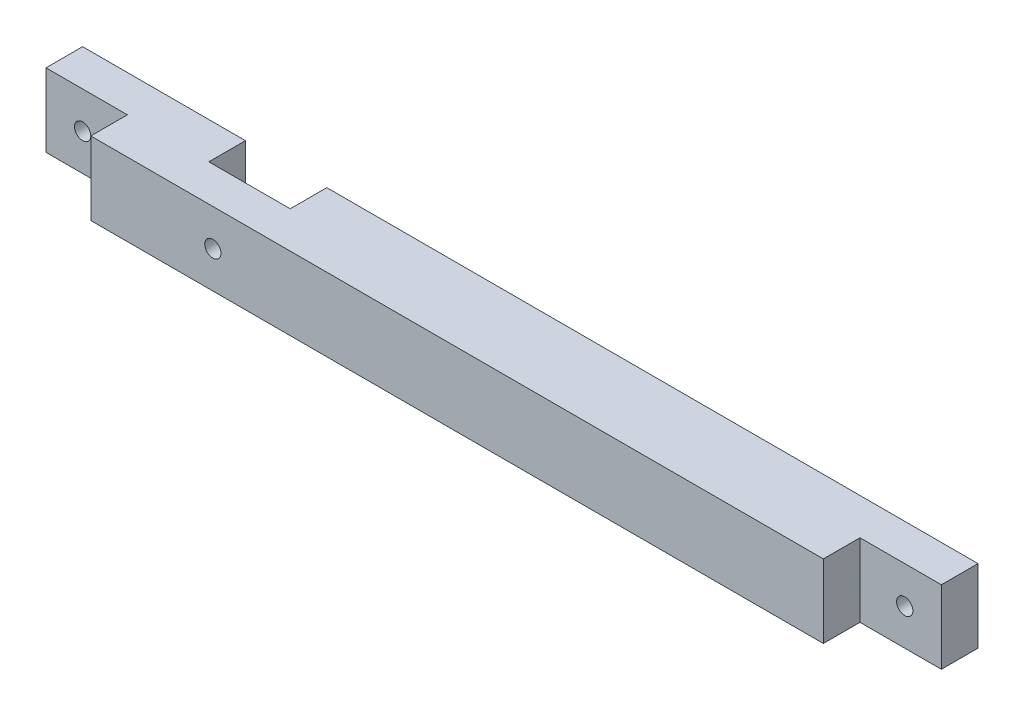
ISO-10303-21;
HEADER;
FILE_DESCRIPTION(('STEP AP214'),'2;1');
FILE_NAME('part.step','',(''),(''),'','','');
FILE_SCHEMA(('AUTOMOTIVE_DESIGN { 1 0 10303 214 1 1 1 1 }'));
ENDSEC;
DATA;
#1=APPLICATION_CONTEXT('core data for automotive mechanical design processes');
#2=APPLICATION_PROTOCOL_DEFINITION('international standard','automotive_design',2000,#1);
#3=PRODUCT_CONTEXT('',#1,'mechanical');
#4=PRODUCT('Part','Part','',(#3));
#5=PRODUCT_RELATED_PRODUCT_CATEGORY('part','',(#4));
#6=PRODUCT_DEFINITION_FORMATION('','',#4);
#7=PRODUCT_DEFINITION_CONTEXT('part definition',#1,'design');
#8=PRODUCT_DEFINITION('design','',#6,#7);
#9=PRODUCT_DEFINITION_SHAPE('','',#8);
#10=(LENGTH_UNIT() NAMED_UNIT(*) SI_UNIT(.MILLI.,.METRE.));
#11=(NAMED_UNIT(*) PLANE_ANGLE_UNIT() SI_UNIT($,.RADIAN.));
#12=(NAMED_UNIT(*) SI_UNIT($,.STERADIAN.) SOLID_ANGLE_UNIT());
#13=UNCERTAINTY_MEASURE_WITH_UNIT(LENGTH_MEASURE(1.E-05),#10,'distance_accuracy_value','');
#14=(GEOMETRIC_REPRESENTATION_CONTEXT(3) GLOBAL_UNCERTAINTY_ASSIGNED_CONTEXT((#13)) GLOBAL_UNIT_ASSIGNED_CONTEXT((#10,
#11,#12)) REPRESENTATION_CONTEXT('',''));
#15=CARTESIAN_POINT('',(0.,0.,0.));
#16=DIRECTION('',(0.,0.,1.));
#17=DIRECTION('',(1.,0.,0.));
#18=AXIS2_PLACEMENT_3D('',#15,#16,#17);
#19=CARTESIAN_POINT('',(-67.2716845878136,-100.617562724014,0.));
#20=DIRECTION('',(0.,0.,-1.));
#21=DIRECTION('',(-1.,0.,0.));
#22=AXIS2_PLACEMENT_3D('',#19,#20,#21);
#23=PLANE('',#22);
#24=DIRECTION('',(0.,1.,0.));
#25=VECTOR('',#24,1.);
#26=CARTESIAN_POINT('',(-47.2716845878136,-100.617562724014,0.));
#27=LINE('',#26,#25);
#28=CARTESIAN_POINT('',(-47.2716845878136,-109.617562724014,0.));
#29=VERTEX_POINT('',#28);
#30=CARTESIAN_POINT('',(-47.2716845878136,-100.617562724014,0.));
#31=VERTEX_POINT('',#30);
#32=EDGE_CURVE('E123',#29,#31,#27,.T.);
#33=ORIENTED_EDGE('',*,*,#32,.F.);
#34=DIRECTION('',(1.,0.,0.));
#35=VECTOR('',#34,1.);
#36=CARTESIAN_POINT('',(-67.2716845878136,-109.617562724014,0.));
#37=LINE('',#36,#35);
#38=CARTESIAN_POINT('',(-67.2716845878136,-109.617562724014,0.));
#39=VERTEX_POINT('',#38);
#40=EDGE_CURVE('E212',#39,#29,#37,.T.);
#41=ORIENTED_EDGE('',*,*,#40,.F.);
#42=DIRECTION('',(0.,-1.,0.));
#43=VECTOR('',#42,1.);
#44=CARTESIAN_POINT('',(-67.2716845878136,-109.617562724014,0.));
#45=LINE('',#44,#43);
#46=CARTESIAN_POINT('',(-67.2716845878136,-100.617562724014,0.));
#47=VERTEX_POINT('',#46);
#48=EDGE_CURVE('E200',#47,#39,#45,.T.);
#49=ORIENTED_EDGE('',*,*,#48,.F.);
#50=DIRECTION('',(-1.,0.,0.));
#51=VECTOR('',#50,1.);
#52=CARTESIAN_POINT('',(-67.2716845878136,-100.617562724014,0.));
#53=LINE('',#52,#51);
#54=EDGE_CURVE('E218',#31,#47,#53,.T.);
#55=ORIENTED_EDGE('',*,*,#54,.F.);
#56=EDGE_LOOP('',(#33,#41,#49,#55));
#57=FACE_BOUND('',#56,.T.);
#58=CARTESIAN_POINT('',(-62.7716845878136,-105.117562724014,0.));
#59=DIRECTION('',(0.,0.,1.));
#60=DIRECTION('',(1.,0.,0.));
#61=AXIS2_PLACEMENT_3D('',#58,#59,#60);
#62=CIRCLE('',#61,0.999999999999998);
#63=CARTESIAN_POINT('',(-61.7716845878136,-105.117562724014,0.));
#64=VERTEX_POINT('',#63);
#65=EDGE_CURVE('E156',#64,#64,#62,.T.);
#66=ORIENTED_EDGE('',*,*,#65,.T.);
#67=EDGE_LOOP('',(#66));
#68=FACE_BOUND('',#67,.T.);
#69=ADVANCED_FACE('F30',(#57,#68),#23,.T.);
#70=CARTESIAN_POINT('',(42.7283154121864,-109.617562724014,9.));
#71=DIRECTION('',(-1.,0.,0.));
#72=DIRECTION('',(0.,0.,1.));
#73=AXIS2_PLACEMENT_3D('',#70,#71,#72);
#74=PLANE('',#73);
#75=DIRECTION('',(0.,1.,0.));
#76=VECTOR('',#75,1.);
#77=CARTESIAN_POINT('',(42.7283154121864,-109.617562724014,4.5));
#78=LINE('',#77,#76);
#79=CARTESIAN_POINT('',(42.7283154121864,-109.617562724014,4.5));
#80=VERTEX_POINT('',#79);
#81=CARTESIAN_POINT('',(42.7283154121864,-100.617562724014,4.5));
#82=VERTEX_POINT('',#81);
#83=EDGE_CURVE('E168',#80,#82,#78,.T.);
#84=ORIENTED_EDGE('',*,*,#83,.F.);
#85=DIRECTION('',(0.,0.,-1.));
#86=VECTOR('',#85,1.);
#87=CARTESIAN_POINT('',(42.7283154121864,-109.617562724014,9.));
#88=LINE('',#87,#86);
#89=CARTESIAN_POINT('',(42.7283154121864,-109.617562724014,0.));
#90=VERTEX_POINT('',#89);
#91=EDGE_CURVE('E38',#80,#90,#88,.T.);
#92=ORIENTED_EDGE('',*,*,#91,.T.);
#93=DIRECTION('',(0.,1.,0.));
#94=VECTOR('',#93,1.);
#95=CARTESIAN_POINT('',(42.7283154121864,-109.617562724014,0.));
#96=LINE('',#95,#94);
#97=CARTESIAN_POINT('',(42.7283154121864,-100.617562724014,0.));
#98=VERTEX_POINT('',#97);
#99=EDGE_CURVE('E215',#90,#98,#96,.T.);
#100=ORIENTED_EDGE('',*,*,#99,.T.);
#101=DIRECTION('',(0.,0.,-1.));
#102=VECTOR('',#101,1.);
#103=CARTESIAN_POINT('',(42.7283154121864,-100.617562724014,9.));
#104=LINE('',#103,#102);
#105=EDGE_CURVE('E222',#82,#98,#104,.T.);
#106=ORIENTED_EDGE('',*,*,#105,.F.);
#107=EDGE_LOOP('',(#84,#92,#100,#106));
#108=FACE_BOUND('',#107,.T.);
#109=ADVANCED_FACE('F228',(#108),#74,.F.);
#110=CARTESIAN_POINT('',(-67.2716845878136,-109.617562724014,9.));
#111=DIRECTION('',(1.,0.,0.));
#112=DIRECTION('',(0.,0.,-1.));
#113=AXIS2_PLACEMENT_3D('',#110,#111,#112);
#114=PLANE('',#113);
#115=DIRECTION('',(0.,0.,-1.));
#116=VECTOR('',#115,1.);
#117=CARTESIAN_POINT('',(-67.2716845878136,-109.617562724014,9.));
#118=LINE('',#117,#116);
#119=CARTESIAN_POINT('',(-67.2716845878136,-109.617562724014,4.5));
#120=VERTEX_POINT('',#119);
#121=EDGE_CURVE('E11',#120,#39,#118,.T.);
#122=ORIENTED_EDGE('',*,*,#121,.F.);
#123=DIRECTION('',(0.,-1.,0.));
#124=VECTOR('',#123,1.);
#125=CARTESIAN_POINT('',(-67.2716845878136,-109.617562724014,4.5));
#126=LINE('',#125,#124);
#127=CARTESIAN_POINT('',(-67.2716845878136,-100.617562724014,4.5));
#128=VERTEX_POINT('',#127);
#129=EDGE_CURVE('E184',#128,#120,#126,.T.);
#130=ORIENTED_EDGE('',*,*,#129,.F.);
#131=DIRECTION('',(0.,0.,-1.));
#132=VECTOR('',#131,1.);
#133=CARTESIAN_POINT('',(-67.2716845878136,-100.617562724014,9.));
#134=LINE('',#133,#132);
#135=EDGE_CURVE('E208',#128,#47,#134,.T.);
#136=ORIENTED_EDGE('',*,*,#135,.T.);
#137=ORIENTED_EDGE('',*,*,#48,.T.);
#138=EDGE_LOOP('',(#122,#130,#136,#137));
#139=FACE_BOUND('',#138,.T.);
#140=ADVANCED_FACE('F32',(#139),#114,.F.);
#141=CARTESIAN_POINT('',(-67.2716845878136,-109.617562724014,9.));
#142=DIRECTION('',(0.,1.,0.));
#143=DIRECTION('',(0.,0.,1.));
#144=AXIS2_PLACEMENT_3D('',#141,#142,#143);
#145=PLANE('',#144);
#146=ORIENTED_EDGE('',*,*,#40,.T.);
#147=DIRECTION('',(0.,0.,-1.));
#148=VECTOR('',#147,1.);
#149=CARTESIAN_POINT('',(-47.2716845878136,-109.617562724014,4.5));
#150=LINE('',#149,#148);
#151=CARTESIAN_POINT('',(-47.2716845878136,-109.617562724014,4.5));
#152=VERTEX_POINT('',#151);
#153=EDGE_CURVE('E149',#152,#29,#150,.T.);
#154=ORIENTED_EDGE('',*,*,#153,.F.);
#155=DIRECTION('',(-1.,0.,0.));
#156=VECTOR('',#155,1.);
#157=CARTESIAN_POINT('',(-47.2716845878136,-109.617562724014,4.5));
#158=LINE('',#157,#156);
#159=CARTESIAN_POINT('',(-37.2716845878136,-109.617562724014,4.5));
#160=VERTEX_POINT('',#159);
#161=EDGE_CURVE('E127',#160,#152,#158,.T.);
#162=ORIENTED_EDGE('',*,*,#161,.F.);
#163=DIRECTION('',(0.,0.,-1.));
#164=VECTOR('',#163,1.);
#165=CARTESIAN_POINT('',(-37.2716845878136,-109.617562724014,4.5));
#166=LINE('',#165,#164);
#167=CARTESIAN_POINT('',(-37.2716845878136,-109.617562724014,0.));
#168=VERTEX_POINT('',#167);
#169=EDGE_CURVE('E152',#160,#168,#166,.T.);
#170=ORIENTED_EDGE('',*,*,#169,.T.);
#171=EDGE_CURVE('E211',#168,#90,#37,.T.);
#172=ORIENTED_EDGE('',*,*,#171,.T.);
#173=ORIENTED_EDGE('',*,*,#91,.F.);
#174=DIRECTION('',(1.,0.,0.));
#175=VECTOR('',#174,1.);
#176=CARTESIAN_POINT('',(42.7283154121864,-109.617562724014,4.5));
#177=LINE('',#176,#175);
#178=CARTESIAN_POINT('',(32.7283154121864,-109.617562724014,4.5));
#179=VERTEX_POINT('',#178);
#180=EDGE_CURVE('E176',#179,#80,#177,.T.);
#181=ORIENTED_EDGE('',*,*,#180,.F.);
#182=DIRECTION('',(0.,0.,1.));
#183=VECTOR('',#182,1.);
#184=CARTESIAN_POINT('',(32.7283154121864,-109.617562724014,4.5));
#185=LINE('',#184,#183);
#186=CARTESIAN_POINT('',(32.7283154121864,-109.617562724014,9.));
#187=VERTEX_POINT('',#186);
#188=EDGE_CURVE('E179',#179,#187,#185,.T.);
#189=ORIENTED_EDGE('',*,*,#188,.T.);
#190=DIRECTION('',(1.,0.,0.));
#191=VECTOR('',#190,1.);
#192=CARTESIAN_POINT('',(-67.2716845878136,-109.617562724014,9.));
#193=LINE('',#192,#191);
#194=CARTESIAN_POINT('',(-57.2716845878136,-109.617562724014,9.));
#195=VERTEX_POINT('',#194);
#196=EDGE_CURVE('E202',#195,#187,#193,.T.);
#197=ORIENTED_EDGE('',*,*,#196,.F.);
#198=DIRECTION('',(0.,0.,1.));
#199=VECTOR('',#198,1.);
#200=CARTESIAN_POINT('',(-57.2716845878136,-109.617562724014,4.5));
#201=LINE('',#200,#199);
#202=CARTESIAN_POINT('',(-57.2716845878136,-109.617562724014,4.5));
#203=VERTEX_POINT('',#202);
#204=EDGE_CURVE('E194',#203,#195,#201,.T.);
#205=ORIENTED_EDGE('',*,*,#204,.F.);
#206=DIRECTION('',(1.,0.,0.));
#207=VECTOR('',#206,1.);
#208=CARTESIAN_POINT('',(-67.2716845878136,-109.617562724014,4.5));
#209=LINE('',#208,#207);
#210=EDGE_CURVE('E186',#120,#203,#209,.T.);
#211=ORIENTED_EDGE('',*,*,#210,.F.);
#212=ORIENTED_EDGE('',*,*,#121,.T.);
#213=EDGE_LOOP('',(#146,#154,#162,#170,#172,#173,#181,#189,#197,#205,#211,#212));
#214=FACE_BOUND('',#213,.T.);
#215=ADVANCED_FACE('F241',(#214),#145,.F.);
#216=CARTESIAN_POINT('',(-67.2716845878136,-100.617562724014,9.));
#217=DIRECTION('',(0.,-1.,0.));
#218=DIRECTION('',(0.,0.,-1.));
#219=AXIS2_PLACEMENT_3D('',#216,#217,#218);
#220=PLANE('',#219);
#221=DIRECTION('',(1.,0.,0.));
#222=VECTOR('',#221,1.);
#223=CARTESIAN_POINT('',(-47.2716845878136,-100.617562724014,4.5));
#224=LINE('',#223,#222);
#225=CARTESIAN_POINT('',(-47.2716845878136,-100.617562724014,4.5));
#226=VERTEX_POINT('',#225);
#227=CARTESIAN_POINT('',(-37.2716845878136,-100.617562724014,4.5));
#228=VERTEX_POINT('',#227);
#229=EDGE_CURVE('E133',#226,#228,#224,.T.);
#230=ORIENTED_EDGE('',*,*,#229,.F.);
#231=DIRECTION('',(0.,0.,-1.));
#232=VECTOR('',#231,1.);
#233=CARTESIAN_POINT('',(-47.2716845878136,-100.617562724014,4.5));
#234=LINE('',#233,#232);
#235=EDGE_CURVE('E117',#226,#31,#234,.T.);
#236=ORIENTED_EDGE('',*,*,#235,.T.);
#237=ORIENTED_EDGE('',*,*,#54,.T.);
#238=ORIENTED_EDGE('',*,*,#135,.F.);
#239=DIRECTION('',(-1.,0.,0.));
#240=VECTOR('',#239,1.);
#241=CARTESIAN_POINT('',(-67.2716845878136,-100.617562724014,4.5));
#242=LINE('',#241,#240);
#243=CARTESIAN_POINT('',(-57.2716845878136,-100.617562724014,4.5));
#244=VERTEX_POINT('',#243);
#245=EDGE_CURVE('E192',#244,#128,#242,.T.);
#246=ORIENTED_EDGE('',*,*,#245,.F.);
#247=DIRECTION('',(0.,0.,1.));
#248=VECTOR('',#247,1.);
#249=CARTESIAN_POINT('',(-57.2716845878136,-100.617562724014,4.5));
#250=LINE('',#249,#248);
#251=CARTESIAN_POINT('',(-57.2716845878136,-100.617562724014,9.));
#252=VERTEX_POINT('',#251);
#253=EDGE_CURVE('E197',#244,#252,#250,.T.);
#254=ORIENTED_EDGE('',*,*,#253,.T.);
#255=DIRECTION('',(-1.,0.,0.));
#256=VECTOR('',#255,1.);
#257=CARTESIAN_POINT('',(-67.2716845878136,-100.617562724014,9.));
#258=LINE('',#257,#256);
#259=CARTESIAN_POINT('',(32.7283154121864,-100.617562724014,9.));
#260=VERTEX_POINT('',#259);
#261=EDGE_CURVE('E205',#260,#252,#258,.T.);
#262=ORIENTED_EDGE('',*,*,#261,.F.);
#263=DIRECTION('',(0.,0.,1.));
#264=VECTOR('',#263,1.);
#265=CARTESIAN_POINT('',(32.7283154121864,-100.617562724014,4.5));
#266=LINE('',#265,#264);
#267=CARTESIAN_POINT('',(32.7283154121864,-100.617562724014,4.5));
#268=VERTEX_POINT('',#267);
#269=EDGE_CURVE('E53',#268,#260,#266,.T.);
#270=ORIENTED_EDGE('',*,*,#269,.F.);
#271=DIRECTION('',(-1.,0.,0.));
#272=VECTOR('',#271,1.);
#273=CARTESIAN_POINT('',(42.7283154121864,-100.617562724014,4.5));
#274=LINE('',#273,#272);
#275=EDGE_CURVE('E170',#82,#268,#274,.T.);
#276=ORIENTED_EDGE('',*,*,#275,.F.);
#277=ORIENTED_EDGE('',*,*,#105,.T.);
#278=CARTESIAN_POINT('',(-37.2716845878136,-100.617562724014,0.));
#279=VERTEX_POINT('',#278);
#280=EDGE_CURVE('E206',#98,#279,#53,.T.);
#281=ORIENTED_EDGE('',*,*,#280,.T.);
#282=DIRECTION('',(0.,0.,-1.));
#283=VECTOR('',#282,1.);
#284=CARTESIAN_POINT('',(-37.2716845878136,-100.617562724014,4.5));
#285=LINE('',#284,#283);
#286=EDGE_CURVE('E45',#228,#279,#285,.T.);
#287=ORIENTED_EDGE('',*,*,#286,.F.);
#288=EDGE_LOOP('',(#230,#236,#237,#238,#246,#254,#262,#270,#276,#277,#281,#287));
#289=FACE_BOUND('',#288,.T.);
#290=ADVANCED_FACE('F138',(#289),#220,.F.);
#291=CARTESIAN_POINT('',(-67.2716845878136,-100.617562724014,9.));
#292=DIRECTION('',(0.,0.,-1.));
#293=DIRECTION('',(-1.,0.,0.));
#294=AXIS2_PLACEMENT_3D('',#291,#292,#293);
#295=PLANE('',#294);
#296=CARTESIAN_POINT('',(-42.2716845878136,-105.117562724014,9.));
#297=DIRECTION('',(0.,0.,-1.));
#298=DIRECTION('',(-1.,0.,0.));
#299=AXIS2_PLACEMENT_3D('',#296,#297,#298);
#300=CIRCLE('',#299,0.999999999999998);
#301=CARTESIAN_POINT('',(-43.2716845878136,-105.117562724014,9.));
#302=VERTEX_POINT('',#301);
#303=EDGE_CURVE('E147',#302,#302,#300,.T.);
#304=ORIENTED_EDGE('',*,*,#303,.T.);
#305=EDGE_LOOP('',(#304));
#306=FACE_BOUND('',#305,.T.);
#307=ORIENTED_EDGE('',*,*,#196,.T.);
#308=DIRECTION('',(0.,-1.,0.));
#309=VECTOR('',#308,1.);
#310=CARTESIAN_POINT('',(32.7283154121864,-109.617562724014,9.));
#311=LINE('',#310,#309);
#312=EDGE_CURVE('E165',#260,#187,#311,.T.);
#313=ORIENTED_EDGE('',*,*,#312,.F.);
#314=ORIENTED_EDGE('',*,*,#261,.T.);
#315=DIRECTION('',(0.,1.,0.));
#316=VECTOR('',#315,1.);
#317=CARTESIAN_POINT('',(-57.2716845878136,-109.617562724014,9.));
#318=LINE('',#317,#316);
#319=EDGE_CURVE('E182',#195,#252,#318,.T.);
#320=ORIENTED_EDGE('',*,*,#319,.F.);
#321=EDGE_LOOP('',(#307,#313,#314,#320));
#322=FACE_BOUND('',#321,.T.);
#323=ADVANCED_FACE('F246',(#306,#322),#295,.F.);
#324=DIRECTION('',(0.,-1.,0.));
#325=VECTOR('',#324,1.);
#326=CARTESIAN_POINT('',(-37.2716845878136,-100.617562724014,0.));
#327=LINE('',#326,#325);
#328=EDGE_CURVE('E136',#279,#168,#327,.T.);
#329=ORIENTED_EDGE('',*,*,#328,.F.);
#330=ORIENTED_EDGE('',*,*,#280,.F.);
#331=ORIENTED_EDGE('',*,*,#99,.F.);
#332=ORIENTED_EDGE('',*,*,#171,.F.);
#333=EDGE_LOOP('',(#329,#330,#331,#332));
#334=FACE_BOUND('',#333,.T.);
#335=CARTESIAN_POINT('',(38.2284017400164,-105.145436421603,0.));
#336=DIRECTION('',(0.,0.,1.));
#337=DIRECTION('',(1.,0.,0.));
#338=AXIS2_PLACEMENT_3D('',#335,#336,#337);
#339=CIRCLE('',#338,0.999999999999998);
#340=CARTESIAN_POINT('',(39.2284017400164,-105.145436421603,0.));
#341=VERTEX_POINT('',#340);
#342=EDGE_CURVE('E162',#341,#341,#339,.T.);
#343=ORIENTED_EDGE('',*,*,#342,.T.);
#344=EDGE_LOOP('',(#343));
#345=FACE_BOUND('',#344,.T.);
#346=ADVANCED_FACE('F235',(#334,#345),#23,.T.);
#347=CARTESIAN_POINT('',(-57.2716845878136,-109.617562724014,4.5));
#348=DIRECTION('',(1.,0.,0.));
#349=DIRECTION('',(0.,1.,0.));
#350=AXIS2_PLACEMENT_3D('',#347,#348,#349);
#351=PLANE('',#350);
#352=ORIENTED_EDGE('',*,*,#319,.T.);
#353=ORIENTED_EDGE('',*,*,#253,.F.);
#354=DIRECTION('',(0.,1.,0.));
#355=VECTOR('',#354,1.);
#356=CARTESIAN_POINT('',(-57.2716845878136,-109.617562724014,4.5));
#357=LINE('',#356,#355);
#358=EDGE_CURVE('E189',#203,#244,#357,.T.);
#359=ORIENTED_EDGE('',*,*,#358,.F.);
#360=ORIENTED_EDGE('',*,*,#204,.T.);
#361=EDGE_LOOP('',(#352,#353,#359,#360));
#362=FACE_BOUND('',#361,.T.);
#363=ADVANCED_FACE('F248',(#362),#351,.F.);
#364=CARTESIAN_POINT('',(-67.2716845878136,-100.617562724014,4.5));
#365=DIRECTION('',(0.,0.,-1.));
#366=DIRECTION('',(-1.,0.,0.));
#367=AXIS2_PLACEMENT_3D('',#364,#365,#366);
#368=PLANE('',#367);
#369=CARTESIAN_POINT('',(-62.7716845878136,-105.117562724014,4.5));
#370=DIRECTION('',(0.,0.,1.));
#371=DIRECTION('',(1.,0.,0.));
#372=AXIS2_PLACEMENT_3D('',#369,#370,#371);
#373=CIRCLE('',#372,0.999999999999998);
#374=CARTESIAN_POINT('',(-61.7716845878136,-105.117562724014,4.5));
#375=VERTEX_POINT('',#374);
#376=EDGE_CURVE('E151',#375,#375,#373,.T.);
#377=ORIENTED_EDGE('',*,*,#376,.F.);
#378=EDGE_LOOP('',(#377));
#379=FACE_BOUND('',#378,.T.);
#380=ORIENTED_EDGE('',*,*,#129,.T.);
#381=ORIENTED_EDGE('',*,*,#210,.T.);
#382=ORIENTED_EDGE('',*,*,#358,.T.);
#383=ORIENTED_EDGE('',*,*,#245,.T.);
#384=EDGE_LOOP('',(#380,#381,#382,#383));
#385=FACE_BOUND('',#384,.T.);
#386=ADVANCED_FACE('F253',(#379,#385),#368,.F.);
#387=CARTESIAN_POINT('',(32.7283154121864,-109.617562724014,4.5));
#388=DIRECTION('',(-1.,0.,0.));
#389=DIRECTION('',(0.,0.,1.));
#390=AXIS2_PLACEMENT_3D('',#387,#388,#389);
#391=PLANE('',#390);
#392=ORIENTED_EDGE('',*,*,#312,.T.);
#393=ORIENTED_EDGE('',*,*,#188,.F.);
#394=DIRECTION('',(0.,-1.,0.));
#395=VECTOR('',#394,1.);
#396=CARTESIAN_POINT('',(32.7283154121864,-109.617562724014,4.5));
#397=LINE('',#396,#395);
#398=EDGE_CURVE('E173',#268,#179,#397,.T.);
#399=ORIENTED_EDGE('',*,*,#398,.F.);
#400=ORIENTED_EDGE('',*,*,#269,.T.);
#401=EDGE_LOOP('',(#392,#393,#399,#400));
#402=FACE_BOUND('',#401,.T.);
#403=ADVANCED_FACE('F273',(#402),#391,.F.);
#404=CARTESIAN_POINT('',(42.7283154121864,-100.617562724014,4.5));
#405=DIRECTION('',(0.,0.,1.));
#406=DIRECTION('',(1.,0.,0.));
#407=AXIS2_PLACEMENT_3D('',#404,#405,#406);
#408=PLANE('',#407);
#409=CARTESIAN_POINT('',(38.2284017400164,-105.145436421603,4.5));
#410=DIRECTION('',(0.,0.,1.));
#411=DIRECTION('',(1.,0.,0.));
#412=AXIS2_PLACEMENT_3D('',#409,#410,#411);
#413=CIRCLE('',#412,0.999999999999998);
#414=CARTESIAN_POINT('',(39.2284017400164,-105.145436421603,4.5));
#415=VERTEX_POINT('',#414);
#416=EDGE_CURVE('E159',#415,#415,#413,.T.);
#417=ORIENTED_EDGE('',*,*,#416,.F.);
#418=EDGE_LOOP('',(#417));
#419=FACE_BOUND('',#418,.T.);
#420=ORIENTED_EDGE('',*,*,#83,.T.);
#421=ORIENTED_EDGE('',*,*,#275,.T.);
#422=ORIENTED_EDGE('',*,*,#398,.T.);
#423=ORIENTED_EDGE('',*,*,#180,.T.);
#424=EDGE_LOOP('',(#420,#421,#422,#423));
#425=FACE_BOUND('',#424,.T.);
#426=ADVANCED_FACE('F240',(#419,#425),#408,.T.);
#427=CARTESIAN_POINT('',(38.2284017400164,-105.145436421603,0.));
#428=DIRECTION('',(0.,0.,1.));
#429=DIRECTION('',(1.,0.,0.));
#430=AXIS2_PLACEMENT_3D('',#427,#428,#429);
#431=CYLINDRICAL_SURFACE('',#430,0.999999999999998);
#432=ORIENTED_EDGE('',*,*,#342,.F.);
#433=EDGE_LOOP('',(#432));
#434=FACE_BOUND('',#433,.T.);
#435=ORIENTED_EDGE('',*,*,#416,.T.);
#436=EDGE_LOOP('',(#435));
#437=FACE_BOUND('',#436,.T.);
#438=ADVANCED_FACE('F268',(#434,#437),#431,.F.);
#439=CARTESIAN_POINT('',(-62.7716845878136,-105.117562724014,0.));
#440=DIRECTION('',(0.,0.,1.));
#441=DIRECTION('',(1.,0.,0.));
#442=AXIS2_PLACEMENT_3D('',#439,#440,#441);
#443=CYLINDRICAL_SURFACE('',#442,0.999999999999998);
#444=ORIENTED_EDGE('',*,*,#65,.F.);
#445=EDGE_LOOP('',(#444));
#446=FACE_BOUND('',#445,.T.);
#447=ORIENTED_EDGE('',*,*,#376,.T.);
#448=EDGE_LOOP('',(#447));
#449=FACE_BOUND('',#448,.T.);
#450=ADVANCED_FACE('F265',(#446,#449),#443,.F.);
#451=CARTESIAN_POINT('',(-47.2716845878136,-100.617562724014,4.5));
#452=DIRECTION('',(-1.,0.,0.));
#453=DIRECTION('',(0.,0.,1.));
#454=AXIS2_PLACEMENT_3D('',#451,#452,#453);
#455=PLANE('',#454);
#456=ORIENTED_EDGE('',*,*,#32,.T.);
#457=ORIENTED_EDGE('',*,*,#235,.F.);
#458=DIRECTION('',(0.,1.,0.));
#459=VECTOR('',#458,1.);
#460=CARTESIAN_POINT('',(-47.2716845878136,-100.617562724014,4.5));
#461=LINE('',#460,#459);
#462=EDGE_CURVE('E120',#152,#226,#461,.T.);
#463=ORIENTED_EDGE('',*,*,#462,.F.);
#464=ORIENTED_EDGE('',*,*,#153,.T.);
#465=EDGE_LOOP('',(#456,#457,#463,#464));
#466=FACE_BOUND('',#465,.T.);
#467=ADVANCED_FACE('F119',(#466),#455,.F.);
#468=CARTESIAN_POINT('',(-37.2716845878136,-100.617562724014,4.5));
#469=DIRECTION('',(1.,0.,0.));
#470=DIRECTION('',(0.,0.,-1.));
#471=AXIS2_PLACEMENT_3D('',#468,#469,#470);
#472=PLANE('',#471);
#473=ORIENTED_EDGE('',*,*,#328,.T.);
#474=ORIENTED_EDGE('',*,*,#169,.F.);
#475=DIRECTION('',(0.,-1.,0.));
#476=VECTOR('',#475,1.);
#477=CARTESIAN_POINT('',(-37.2716845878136,-100.617562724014,4.5));
#478=LINE('',#477,#476);
#479=EDGE_CURVE('E140',#228,#160,#478,.T.);
#480=ORIENTED_EDGE('',*,*,#479,.F.);
#481=ORIENTED_EDGE('',*,*,#286,.T.);
#482=EDGE_LOOP('',(#473,#474,#480,#481));
#483=FACE_BOUND('',#482,.T.);
#484=ADVANCED_FACE('F334',(#483),#472,.F.);
#485=CARTESIAN_POINT('',(-47.2716845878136,-109.617562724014,4.5));
#486=DIRECTION('',(0.,0.,1.));
#487=DIRECTION('',(1.,0.,0.));
#488=AXIS2_PLACEMENT_3D('',#485,#486,#487);
#489=PLANE('',#488);
#490=CARTESIAN_POINT('',(-42.2716845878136,-105.117562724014,4.5));
#491=DIRECTION('',(0.,0.,-1.));
#492=DIRECTION('',(-1.,0.,0.));
#493=AXIS2_PLACEMENT_3D('',#490,#491,#492);
#494=CIRCLE('',#493,0.999999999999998);
#495=CARTESIAN_POINT('',(-43.2716845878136,-105.117562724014,4.5));
#496=VERTEX_POINT('',#495);
#497=EDGE_CURVE('E415',#496,#496,#494,.T.);
#498=ORIENTED_EDGE('',*,*,#497,.F.);
#499=EDGE_LOOP('',(#498));
#500=FACE_BOUND('',#499,.T.);
#501=ORIENTED_EDGE('',*,*,#462,.T.);
#502=ORIENTED_EDGE('',*,*,#229,.T.);
#503=ORIENTED_EDGE('',*,*,#479,.T.);
#504=ORIENTED_EDGE('',*,*,#161,.T.);
#505=EDGE_LOOP('',(#501,#502,#503,#504));
#506=FACE_BOUND('',#505,.T.);
#507=ADVANCED_FACE('F131',(#500,#506),#489,.F.);
#508=CARTESIAN_POINT('',(-42.2716845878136,-105.117562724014,9.));
#509=DIRECTION('',(0.,0.,-1.));
#510=DIRECTION('',(-1.,0.,0.));
#511=AXIS2_PLACEMENT_3D('',#508,#509,#510);
#512=CYLINDRICAL_SURFACE('',#511,0.999999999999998);
#513=ORIENTED_EDGE('',*,*,#303,.F.);
#514=EDGE_LOOP('',(#513));
#515=FACE_BOUND('',#514,.T.);
#516=ORIENTED_EDGE('',*,*,#497,.T.);
#517=EDGE_LOOP('',(#516));
#518=FACE_BOUND('',#517,.T.);
#519=ADVANCED_FACE('F356',(#515,#518),#512,.F.);
#520=CLOSED_SHELL('',(#69,#109,#140,#215,#290,#323,#346,#363,#386,#403,#426,#438,#450,#467,#484,
#507,#519));
#521=MANIFOLD_SOLID_BREP('B2',#520);
#522=ADVANCED_BREP_SHAPE_REPRESENTATION('',(#18,#521),#14);
#523=SHAPE_DEFINITION_REPRESENTATION(#9,#522);
ENDSEC;
END-ISO-10303-21;
